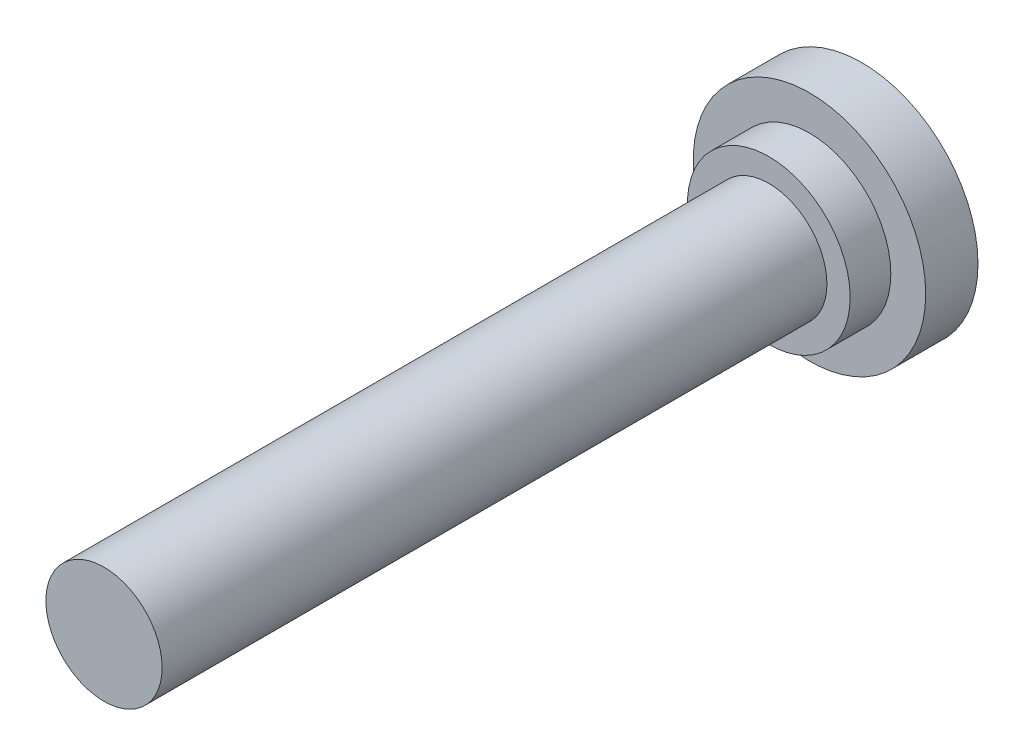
ISO-10303-21;
HEADER;
FILE_DESCRIPTION(('STEP AP214'),'2;1');
FILE_NAME('part.step','',(''),(''),'','','');
FILE_SCHEMA(('AUTOMOTIVE_DESIGN { 1 0 10303 214 1 1 1 1 }'));
ENDSEC;
DATA;
#1=APPLICATION_CONTEXT('core data for automotive mechanical design processes');
#2=APPLICATION_PROTOCOL_DEFINITION('international standard','automotive_design',2000,#1);
#3=PRODUCT_CONTEXT('',#1,'mechanical');
#4=PRODUCT('Part','Part','',(#3));
#5=PRODUCT_RELATED_PRODUCT_CATEGORY('part','',(#4));
#6=PRODUCT_DEFINITION_FORMATION('','',#4);
#7=PRODUCT_DEFINITION_CONTEXT('part definition',#1,'design');
#8=PRODUCT_DEFINITION('design','',#6,#7);
#9=PRODUCT_DEFINITION_SHAPE('','',#8);
#10=(LENGTH_UNIT() NAMED_UNIT(*) SI_UNIT(.MILLI.,.METRE.));
#11=(NAMED_UNIT(*) PLANE_ANGLE_UNIT() SI_UNIT($,.RADIAN.));
#12=(NAMED_UNIT(*) SI_UNIT($,.STERADIAN.) SOLID_ANGLE_UNIT());
#13=UNCERTAINTY_MEASURE_WITH_UNIT(LENGTH_MEASURE(1.E-05),#10,'distance_accuracy_value','');
#14=(GEOMETRIC_REPRESENTATION_CONTEXT(3) GLOBAL_UNCERTAINTY_ASSIGNED_CONTEXT((#13)) GLOBAL_UNIT_ASSIGNED_CONTEXT((#10,
#11,#12)) REPRESENTATION_CONTEXT('',''));
#15=CARTESIAN_POINT('',(0.,0.,0.));
#16=DIRECTION('',(0.,0.,1.));
#17=DIRECTION('',(1.,0.,0.));
#18=AXIS2_PLACEMENT_3D('',#15,#16,#17);
#19=CARTESIAN_POINT('',(0.,0.,130.4));
#20=DIRECTION('',(0.,0.,1.));
#21=DIRECTION('',(1.,0.,0.));
#22=AXIS2_PLACEMENT_3D('',#19,#20,#21);
#23=PLANE('',#22);
#24=CARTESIAN_POINT('',(0.,0.,130.4));
#25=DIRECTION('',(0.,0.,1.));
#26=DIRECTION('',(1.,0.,0.));
#27=AXIS2_PLACEMENT_3D('',#24,#25,#26);
#28=CIRCLE('',#27,10.);
#29=CARTESIAN_POINT('',(10.,0.,130.4));
#30=VERTEX_POINT('',#29);
#31=EDGE_CURVE('E8',#30,#30,#28,.T.);
#32=ORIENTED_EDGE('',*,*,#31,.T.);
#33=EDGE_LOOP('',(#32));
#34=FACE_BOUND('',#33,.T.);
#35=ADVANCED_FACE('F12',(#34),#23,.T.);
#36=CARTESIAN_POINT('',(0.,0.,30.));
#37=DIRECTION('',(0.,0.,1.));
#38=DIRECTION('',(1.,0.,0.));
#39=AXIS2_PLACEMENT_3D('',#36,#37,#38);
#40=CYLINDRICAL_SURFACE('',#39,10.);
#41=CARTESIAN_POINT('',(0.,0.,16.));
#42=DIRECTION('',(0.,0.,1.));
#43=DIRECTION('',(1.,0.,0.));
#44=AXIS2_PLACEMENT_3D('',#41,#42,#43);
#45=CIRCLE('',#44,10.);
#46=CARTESIAN_POINT('',(10.,0.,16.));
#47=VERTEX_POINT('',#46);
#48=EDGE_CURVE('E18',#47,#47,#45,.T.);
#49=ORIENTED_EDGE('',*,*,#48,.T.);
#50=EDGE_LOOP('',(#49));
#51=FACE_BOUND('',#50,.T.);
#52=ORIENTED_EDGE('',*,*,#31,.F.);
#53=EDGE_LOOP('',(#52));
#54=FACE_BOUND('',#53,.T.);
#55=ADVANCED_FACE('F52',(#51,#54),#40,.T.);
#56=CARTESIAN_POINT('',(-10.,0.,16.));
#57=DIRECTION('',(0.,0.,1.));
#58=DIRECTION('',(1.,0.,0.));
#59=AXIS2_PLACEMENT_3D('',#56,#57,#58);
#60=PLANE('',#59);
#61=CARTESIAN_POINT('',(0.,0.,16.));
#62=DIRECTION('',(0.,0.,1.));
#63=DIRECTION('',(1.,0.,0.));
#64=AXIS2_PLACEMENT_3D('',#61,#62,#63);
#65=CIRCLE('',#64,14.);
#66=CARTESIAN_POINT('',(14.,0.,16.));
#67=VERTEX_POINT('',#66);
#68=EDGE_CURVE('E22',#67,#67,#65,.T.);
#69=ORIENTED_EDGE('',*,*,#68,.T.);
#70=EDGE_LOOP('',(#69));
#71=FACE_BOUND('',#70,.T.);
#72=ORIENTED_EDGE('',*,*,#48,.F.);
#73=EDGE_LOOP('',(#72));
#74=FACE_BOUND('',#73,.T.);
#75=ADVANCED_FACE('F57',(#71,#74),#60,.T.);
#76=CARTESIAN_POINT('',(0.,0.,30.));
#77=DIRECTION('',(0.,0.,1.));
#78=DIRECTION('',(1.,0.,0.));
#79=AXIS2_PLACEMENT_3D('',#76,#77,#78);
#80=CYLINDRICAL_SURFACE('',#79,14.);
#81=CARTESIAN_POINT('',(0.,0.,9.));
#82=DIRECTION('',(0.,0.,1.));
#83=DIRECTION('',(1.,0.,0.));
#84=AXIS2_PLACEMENT_3D('',#81,#82,#83);
#85=CIRCLE('',#84,14.);
#86=CARTESIAN_POINT('',(14.,0.,9.));
#87=VERTEX_POINT('',#86);
#88=EDGE_CURVE('E26',#87,#87,#85,.T.);
#89=ORIENTED_EDGE('',*,*,#88,.T.);
#90=EDGE_LOOP('',(#89));
#91=FACE_BOUND('',#90,.T.);
#92=ORIENTED_EDGE('',*,*,#68,.F.);
#93=EDGE_LOOP('',(#92));
#94=FACE_BOUND('',#93,.T.);
#95=ADVANCED_FACE('F62',(#91,#94),#80,.T.);
#96=CARTESIAN_POINT('',(-14.,0.,9.));
#97=DIRECTION('',(0.,0.,1.));
#98=DIRECTION('',(1.,0.,0.));
#99=AXIS2_PLACEMENT_3D('',#96,#97,#98);
#100=PLANE('',#99);
#101=CARTESIAN_POINT('',(0.,0.,9.));
#102=DIRECTION('',(0.,0.,1.));
#103=DIRECTION('',(1.,0.,0.));
#104=AXIS2_PLACEMENT_3D('',#101,#102,#103);
#105=CIRCLE('',#104,20.);
#106=CARTESIAN_POINT('',(20.,0.,9.));
#107=VERTEX_POINT('',#106);
#108=EDGE_CURVE('E31',#107,#107,#105,.T.);
#109=ORIENTED_EDGE('',*,*,#108,.T.);
#110=EDGE_LOOP('',(#109));
#111=FACE_BOUND('',#110,.T.);
#112=ORIENTED_EDGE('',*,*,#88,.F.);
#113=EDGE_LOOP('',(#112));
#114=FACE_BOUND('',#113,.T.);
#115=ADVANCED_FACE('F49',(#111,#114),#100,.T.);
#116=CARTESIAN_POINT('',(0.,0.,30.));
#117=DIRECTION('',(0.,0.,1.));
#118=DIRECTION('',(1.,0.,0.));
#119=AXIS2_PLACEMENT_3D('',#116,#117,#118);
#120=CYLINDRICAL_SURFACE('',#119,20.);
#121=CARTESIAN_POINT('',(0.,0.,0.));
#122=DIRECTION('',(0.,0.,1.));
#123=DIRECTION('',(1.,0.,0.));
#124=AXIS2_PLACEMENT_3D('',#121,#122,#123);
#125=CIRCLE('',#124,20.);
#126=CARTESIAN_POINT('',(20.,0.,0.));
#127=VERTEX_POINT('',#126);
#128=EDGE_CURVE('E34',#127,#127,#125,.T.);
#129=ORIENTED_EDGE('',*,*,#128,.T.);
#130=EDGE_LOOP('',(#129));
#131=FACE_BOUND('',#130,.T.);
#132=ORIENTED_EDGE('',*,*,#108,.F.);
#133=EDGE_LOOP('',(#132));
#134=FACE_BOUND('',#133,.T.);
#135=ADVANCED_FACE('F38',(#131,#134),#120,.T.);
#136=CARTESIAN_POINT('',(-20.,0.,0.));
#137=DIRECTION('',(0.,0.,-1.));
#138=DIRECTION('',(-1.,0.,0.));
#139=AXIS2_PLACEMENT_3D('',#136,#137,#138);
#140=PLANE('',#139);
#141=ORIENTED_EDGE('',*,*,#128,.F.);
#142=EDGE_LOOP('',(#141));
#143=FACE_BOUND('',#142,.T.);
#144=ADVANCED_FACE('F41',(#143),#140,.T.);
#145=CLOSED_SHELL('',(#35,#55,#75,#95,#115,#135,#144));
#146=MANIFOLD_SOLID_BREP('B1',#145);
#147=ADVANCED_BREP_SHAPE_REPRESENTATION('',(#18,#146),#14);
#148=SHAPE_DEFINITION_REPRESENTATION(#9,#147);
ENDSEC;
END-ISO-10303-21;
